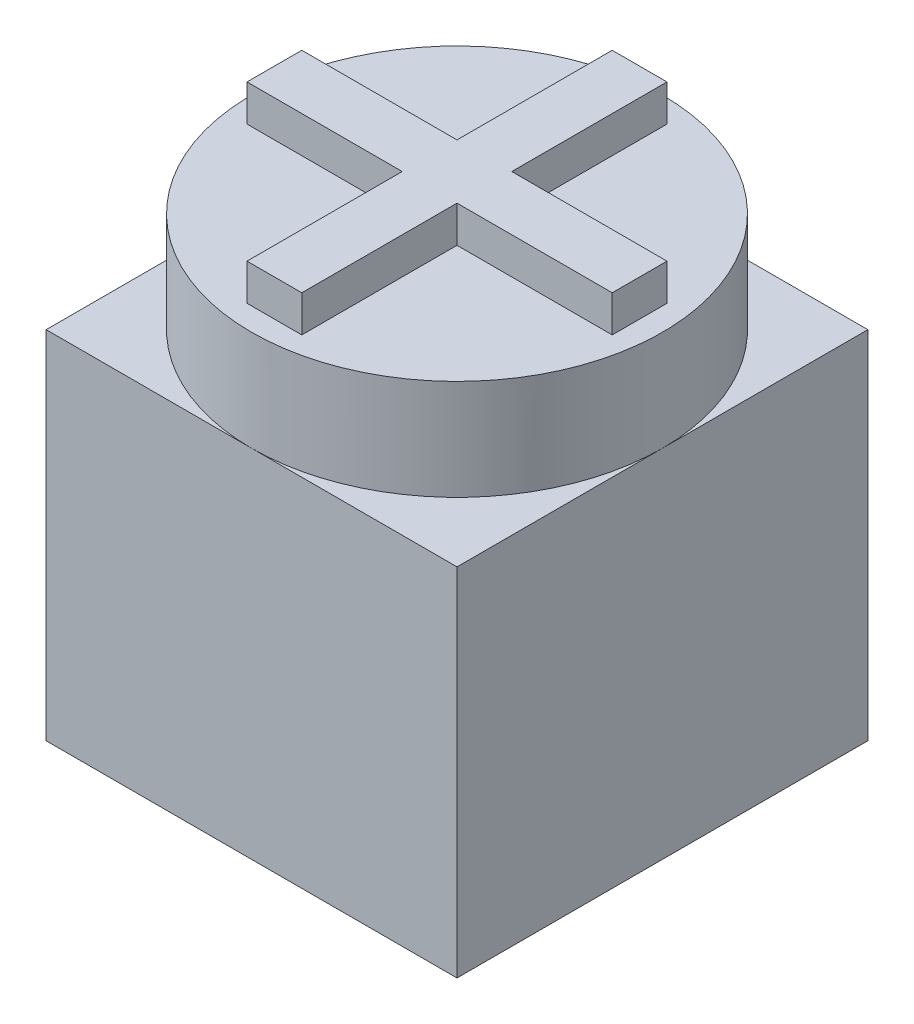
from build123d import *

# Parameters (mm, degrees)
ESQUISSE1_W        = 9
ESQUISSE1_H        = 9
BOSS_EXTRU_1_DEPTH = 7.8
ESQUISSE2_R        = 4.5
BOSS_EXTRU_2_DEPTH = 2.2
ESQUISSE3_W        = 3.4
ESQUISSE3_H        = 1.2
ESQUISSE3_W_2      = 1.2
ESQUISSE3_H_2      = 3.4
BOSS_EXTRU_3_DEPTH = 0.8


with BuildPart() as part:
    # Esquisse1 → Boss.-Extru.1 (new body)
    with BuildSketch(Plane(origin=(0, 0, 0), x_dir=(1, 0, 0), z_dir=(0, 1, 0))):
        Rectangle(ESQUISSE1_W, ESQUISSE1_H)
    extrude(amount=BOSS_EXTRU_1_DEPTH)

    # Esquisse2 → Boss.-Extru.2 (add)
    with BuildSketch(Plane(origin=(0, 7.8, 0), x_dir=(1, 0, 0), z_dir=(0, 1, 0))):
        with Locations(Location((0, 0, 0), (0, 0, 270))):
            Circle(ESQUISSE2_R)
    extrude(amount=BOSS_EXTRU_2_DEPTH)

    # Esquisse3 → Boss.-Extru.3 (add)
    with BuildSketch(Plane(origin=(0, 10, 0), x_dir=(1, 0, 0), z_dir=(0, 1, 0))):
        with Locations((-2.3, 0)):
            Rectangle(ESQUISSE3_W, ESQUISSE3_H)
        with Locations((0, 2.3)):
            Rectangle(ESQUISSE3_W_2, ESQUISSE3_H_2)
        Rectangle(ESQUISSE3_W_2, ESQUISSE3_H)
        with Locations((0, -2.3)):
            Rectangle(ESQUISSE3_W_2, ESQUISSE3_H_2)
        with Locations((2.3, 0)):
            Rectangle(ESQUISSE3_W, ESQUISSE3_H)
    extrude(amount=BOSS_EXTRU_3_DEPTH)


solid = part.part
